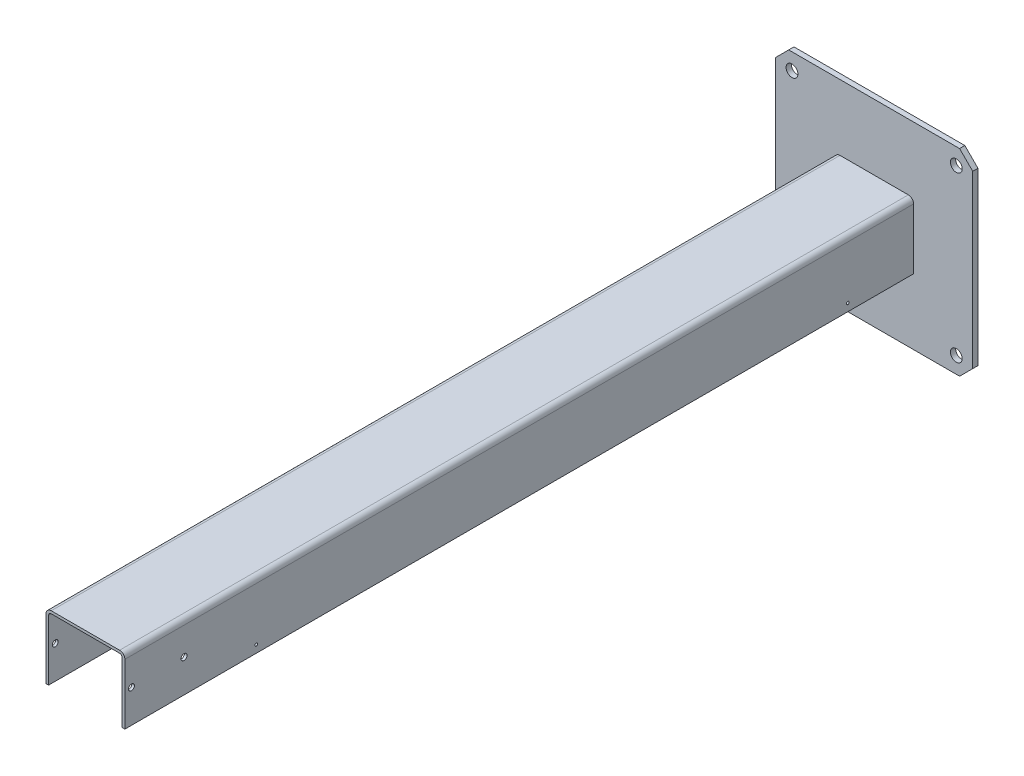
ISO-10303-21;
HEADER;
FILE_DESCRIPTION(('STEP AP214'),'2;1');
FILE_NAME('part.step','',(''),(''),'','','');
FILE_SCHEMA(('AUTOMOTIVE_DESIGN { 1 0 10303 214 1 1 1 1 }'));
ENDSEC;
DATA;
#1=APPLICATION_CONTEXT('core data for automotive mechanical design processes');
#2=APPLICATION_PROTOCOL_DEFINITION('international standard','automotive_design',2000,#1);
#3=PRODUCT_CONTEXT('',#1,'mechanical');
#4=PRODUCT('Part','Part','',(#3));
#5=PRODUCT_RELATED_PRODUCT_CATEGORY('part','',(#4));
#6=PRODUCT_DEFINITION_FORMATION('','',#4);
#7=PRODUCT_DEFINITION_CONTEXT('part definition',#1,'design');
#8=PRODUCT_DEFINITION('design','',#6,#7);
#9=PRODUCT_DEFINITION_SHAPE('','',#8);
#10=(LENGTH_UNIT() NAMED_UNIT(*) SI_UNIT(.MILLI.,.METRE.));
#11=(NAMED_UNIT(*) PLANE_ANGLE_UNIT() SI_UNIT($,.RADIAN.));
#12=(NAMED_UNIT(*) SI_UNIT($,.STERADIAN.) SOLID_ANGLE_UNIT());
#13=UNCERTAINTY_MEASURE_WITH_UNIT(LENGTH_MEASURE(1.E-05),#10,'distance_accuracy_value','');
#14=(GEOMETRIC_REPRESENTATION_CONTEXT(3) GLOBAL_UNCERTAINTY_ASSIGNED_CONTEXT((#13)) GLOBAL_UNIT_ASSIGNED_CONTEXT((#10,
#11,#12)) REPRESENTATION_CONTEXT('',''));
#15=CARTESIAN_POINT('',(0.,0.,0.));
#16=DIRECTION('',(0.,0.,1.));
#17=DIRECTION('',(1.,0.,0.));
#18=AXIS2_PLACEMENT_3D('',#15,#16,#17);
#19=CARTESIAN_POINT('',(-150.,150.,8.));
#20=DIRECTION('',(0.,0.,-1.));
#21=DIRECTION('',(-1.,0.,0.));
#22=AXIS2_PLACEMENT_3D('',#19,#20,#21);
#23=PLANE('',#22);
#24=CARTESIAN_POINT('',(-125.,125.,8.));
#25=DIRECTION('',(0.,0.,1.));
#26=DIRECTION('',(1.,0.,0.));
#27=AXIS2_PLACEMENT_3D('',#24,#25,#26);
#28=CIRCLE('',#27,9.);
#29=CARTESIAN_POINT('',(-116.,125.,8.));
#30=VERTEX_POINT('',#29);
#31=EDGE_CURVE('E379',#30,#30,#28,.T.);
#32=ORIENTED_EDGE('',*,*,#31,.F.);
#33=EDGE_LOOP('',(#32));
#34=FACE_BOUND('',#33,.T.);
#35=CARTESIAN_POINT('',(-125.,-125.,8.));
#36=DIRECTION('',(0.,0.,1.));
#37=DIRECTION('',(1.,0.,0.));
#38=AXIS2_PLACEMENT_3D('',#35,#36,#37);
#39=CIRCLE('',#38,8.99999999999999);
#40=CARTESIAN_POINT('',(-116.,-125.,8.));
#41=VERTEX_POINT('',#40);
#42=EDGE_CURVE('E383',#41,#41,#39,.T.);
#43=ORIENTED_EDGE('',*,*,#42,.F.);
#44=EDGE_LOOP('',(#43));
#45=FACE_BOUND('',#44,.T.);
#46=CARTESIAN_POINT('',(125.,-125.,8.));
#47=DIRECTION('',(0.,0.,1.));
#48=DIRECTION('',(1.,0.,0.));
#49=AXIS2_PLACEMENT_3D('',#46,#47,#48);
#50=CIRCLE('',#49,8.99999999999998);
#51=CARTESIAN_POINT('',(134.,-125.,8.));
#52=VERTEX_POINT('',#51);
#53=EDGE_CURVE('E389',#52,#52,#50,.T.);
#54=ORIENTED_EDGE('',*,*,#53,.F.);
#55=EDGE_LOOP('',(#54));
#56=FACE_BOUND('',#55,.T.);
#57=CARTESIAN_POINT('',(125.,125.,8.));
#58=DIRECTION('',(0.,0.,1.));
#59=DIRECTION('',(1.,0.,0.));
#60=AXIS2_PLACEMENT_3D('',#57,#58,#59);
#61=CIRCLE('',#60,8.99999999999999);
#62=CARTESIAN_POINT('',(134.,125.,8.));
#63=VERTEX_POINT('',#62);
#64=EDGE_CURVE('E395',#63,#63,#61,.T.);
#65=ORIENTED_EDGE('',*,*,#64,.F.);
#66=EDGE_LOOP('',(#65));
#67=FACE_BOUND('',#66,.T.);
#68=DIRECTION('',(0.,-1.,0.));
#69=VECTOR('',#68,1.);
#70=CARTESIAN_POINT('',(-150.,-150.,8.));
#71=LINE('',#70,#69);
#72=CARTESIAN_POINT('',(-150.,130.,8.));
#73=VERTEX_POINT('',#72);
#74=CARTESIAN_POINT('',(-150.,-130.,8.));
#75=VERTEX_POINT('',#74);
#76=EDGE_CURVE('E284',#73,#75,#71,.T.);
#77=ORIENTED_EDGE('',*,*,#76,.T.);
#78=DIRECTION('',(-0.707106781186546,0.70710678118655,0.));
#79=VECTOR('',#78,1.);
#80=CARTESIAN_POINT('',(-130.,-150.,8.));
#81=LINE('',#80,#79);
#82=CARTESIAN_POINT('',(-130.,-150.,8.));
#83=VERTEX_POINT('',#82);
#84=EDGE_CURVE('E327',#75,#83,#81,.F.);
#85=ORIENTED_EDGE('',*,*,#84,.T.);
#86=DIRECTION('',(1.,0.,0.));
#87=VECTOR('',#86,1.);
#88=CARTESIAN_POINT('',(-150.,-150.,8.));
#89=LINE('',#88,#87);
#90=CARTESIAN_POINT('',(130.,-150.,8.));
#91=VERTEX_POINT('',#90);
#92=EDGE_CURVE('E287',#83,#91,#89,.T.);
#93=ORIENTED_EDGE('',*,*,#92,.T.);
#94=DIRECTION('',(-0.70710678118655,-0.707106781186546,0.));
#95=VECTOR('',#94,1.);
#96=CARTESIAN_POINT('',(150.,-130.,8.));
#97=LINE('',#96,#95);
#98=CARTESIAN_POINT('',(150.,-130.,8.));
#99=VERTEX_POINT('',#98);
#100=EDGE_CURVE('E325',#91,#99,#97,.F.);
#101=ORIENTED_EDGE('',*,*,#100,.T.);
#102=DIRECTION('',(0.,1.,0.));
#103=VECTOR('',#102,1.);
#104=CARTESIAN_POINT('',(150.,-150.,8.));
#105=LINE('',#104,#103);
#106=CARTESIAN_POINT('',(150.,130.,8.));
#107=VERTEX_POINT('',#106);
#108=EDGE_CURVE('E291',#99,#107,#105,.T.);
#109=ORIENTED_EDGE('',*,*,#108,.T.);
#110=DIRECTION('',(0.707106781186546,-0.70710678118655,0.));
#111=VECTOR('',#110,1.);
#112=CARTESIAN_POINT('',(130.,150.,8.));
#113=LINE('',#112,#111);
#114=CARTESIAN_POINT('',(130.,150.,8.));
#115=VERTEX_POINT('',#114);
#116=EDGE_CURVE('E57',#107,#115,#113,.F.);
#117=ORIENTED_EDGE('',*,*,#116,.T.);
#118=DIRECTION('',(-1.,0.,0.));
#119=VECTOR('',#118,1.);
#120=CARTESIAN_POINT('',(-150.,150.,8.));
#121=LINE('',#120,#119);
#122=CARTESIAN_POINT('',(-130.,150.,8.));
#123=VERTEX_POINT('',#122);
#124=EDGE_CURVE('E293',#115,#123,#121,.T.);
#125=ORIENTED_EDGE('',*,*,#124,.T.);
#126=DIRECTION('',(0.70710678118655,0.707106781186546,0.));
#127=VECTOR('',#126,1.);
#128=CARTESIAN_POINT('',(-150.,130.,8.));
#129=LINE('',#128,#127);
#130=EDGE_CURVE('E322',#123,#73,#129,.F.);
#131=ORIENTED_EDGE('',*,*,#130,.T.);
#132=EDGE_LOOP('',(#77,#85,#93,#101,#109,#117,#125,#131));
#133=FACE_BOUND('',#132,.T.);
#134=DIRECTION('',(0.,-1.,0.));
#135=VECTOR('',#134,1.);
#136=CARTESIAN_POINT('',(56.,42.,8.));
#137=LINE('',#136,#135);
#138=CARTESIAN_POINT('',(56.,42.,8.));
#139=VERTEX_POINT('',#138);
#140=CARTESIAN_POINT('',(56.,-50.,8.));
#141=VERTEX_POINT('',#140);
#142=EDGE_CURVE('E192',#139,#141,#137,.T.);
#143=ORIENTED_EDGE('',*,*,#142,.F.);
#144=CARTESIAN_POINT('',(52.,42.,8.));
#145=DIRECTION('',(0.,0.,1.));
#146=DIRECTION('',(1.,0.,0.));
#147=AXIS2_PLACEMENT_3D('',#144,#145,#146);
#148=CIRCLE('',#147,4.);
#149=CARTESIAN_POINT('',(52.,46.,8.00000000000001));
#150=VERTEX_POINT('',#149);
#151=EDGE_CURVE('E186',#150,#139,#148,.F.);
#152=ORIENTED_EDGE('',*,*,#151,.F.);
#153=DIRECTION('',(1.,0.,0.));
#154=VECTOR('',#153,1.);
#155=CARTESIAN_POINT('',(-52.,46.,8.));
#156=LINE('',#155,#154);
#157=CARTESIAN_POINT('',(-52.,46.,8.));
#158=VERTEX_POINT('',#157);
#159=EDGE_CURVE('E250',#158,#150,#156,.T.);
#160=ORIENTED_EDGE('',*,*,#159,.F.);
#161=CARTESIAN_POINT('',(-52.,42.,8.));
#162=DIRECTION('',(0.,0.,1.));
#163=DIRECTION('',(1.,0.,0.));
#164=AXIS2_PLACEMENT_3D('',#161,#162,#163);
#165=CIRCLE('',#164,4.);
#166=CARTESIAN_POINT('',(-56.,42.,8.00000000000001));
#167=VERTEX_POINT('',#166);
#168=EDGE_CURVE('E247',#167,#158,#165,.F.);
#169=ORIENTED_EDGE('',*,*,#168,.F.);
#170=DIRECTION('',(0.,1.,0.));
#171=VECTOR('',#170,1.);
#172=CARTESIAN_POINT('',(-56.,-50.,8.));
#173=LINE('',#172,#171);
#174=CARTESIAN_POINT('',(-56.,-50.,8.));
#175=VERTEX_POINT('',#174);
#176=EDGE_CURVE('E244',#175,#167,#173,.T.);
#177=ORIENTED_EDGE('',*,*,#176,.F.);
#178=DIRECTION('',(-1.,0.,0.));
#179=VECTOR('',#178,1.);
#180=CARTESIAN_POINT('',(-56.,-50.,8.));
#181=LINE('',#180,#179);
#182=CARTESIAN_POINT('',(-60.,-50.,8.));
#183=VERTEX_POINT('',#182);
#184=EDGE_CURVE('E242',#175,#183,#181,.T.);
#185=ORIENTED_EDGE('',*,*,#184,.T.);
#186=DIRECTION('',(0.,1.,0.));
#187=VECTOR('',#186,1.);
#188=CARTESIAN_POINT('',(-60.,-50.,8.));
#189=LINE('',#188,#187);
#190=CARTESIAN_POINT('',(-60.,42.,8.));
#191=VERTEX_POINT('',#190);
#192=EDGE_CURVE('E240',#183,#191,#189,.T.);
#193=ORIENTED_EDGE('',*,*,#192,.T.);
#194=CARTESIAN_POINT('',(-52.,42.,8.));
#195=DIRECTION('',(0.,0.,-1.));
#196=DIRECTION('',(-1.,0.,0.));
#197=AXIS2_PLACEMENT_3D('',#194,#195,#196);
#198=CIRCLE('',#197,8.);
#199=CARTESIAN_POINT('',(-52.,50.,8.00000000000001));
#200=VERTEX_POINT('',#199);
#201=EDGE_CURVE('E238',#191,#200,#198,.T.);
#202=ORIENTED_EDGE('',*,*,#201,.T.);
#203=DIRECTION('',(1.,0.,0.));
#204=VECTOR('',#203,1.);
#205=CARTESIAN_POINT('',(-52.,50.,8.));
#206=LINE('',#205,#204);
#207=CARTESIAN_POINT('',(52.,50.,8.));
#208=VERTEX_POINT('',#207);
#209=EDGE_CURVE('E236',#200,#208,#206,.T.);
#210=ORIENTED_EDGE('',*,*,#209,.T.);
#211=CARTESIAN_POINT('',(52.,42.,8.));
#212=DIRECTION('',(0.,0.,-1.));
#213=DIRECTION('',(-1.,0.,0.));
#214=AXIS2_PLACEMENT_3D('',#211,#212,#213);
#215=CIRCLE('',#214,8.);
#216=CARTESIAN_POINT('',(60.,42.,8.00000000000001));
#217=VERTEX_POINT('',#216);
#218=EDGE_CURVE('E234',#208,#217,#215,.T.);
#219=ORIENTED_EDGE('',*,*,#218,.T.);
#220=DIRECTION('',(0.,-1.,0.));
#221=VECTOR('',#220,1.);
#222=CARTESIAN_POINT('',(60.,42.,8.));
#223=LINE('',#222,#221);
#224=CARTESIAN_POINT('',(60.,-50.,8.));
#225=VERTEX_POINT('',#224);
#226=EDGE_CURVE('E232',#217,#225,#223,.T.);
#227=ORIENTED_EDGE('',*,*,#226,.T.);
#228=DIRECTION('',(-1.,0.,0.));
#229=VECTOR('',#228,1.);
#230=CARTESIAN_POINT('',(60.,-50.,8.));
#231=LINE('',#230,#229);
#232=EDGE_CURVE('E229',#225,#141,#231,.T.);
#233=ORIENTED_EDGE('',*,*,#232,.T.);
#234=EDGE_LOOP('',(#143,#152,#160,#169,#177,#185,#193,#202,#210,#219,#227,#233));
#235=FACE_BOUND('',#234,.T.);
#236=ADVANCED_FACE('F34',(#34,#45,#56,#67,#133,#235),#23,.F.);
#237=CARTESIAN_POINT('',(-150.,-150.,8.));
#238=DIRECTION('',(1.,0.,0.));
#239=DIRECTION('',(0.,0.,-1.));
#240=AXIS2_PLACEMENT_3D('',#237,#238,#239);
#241=PLANE('',#240);
#242=DIRECTION('',(0.,-1.,0.));
#243=VECTOR('',#242,1.);
#244=CARTESIAN_POINT('',(-150.,-150.,0.));
#245=LINE('',#244,#243);
#246=CARTESIAN_POINT('',(-150.,130.,0.));
#247=VERTEX_POINT('',#246);
#248=CARTESIAN_POINT('',(-150.,-130.,0.));
#249=VERTEX_POINT('',#248);
#250=EDGE_CURVE('E195',#247,#249,#245,.T.);
#251=ORIENTED_EDGE('',*,*,#250,.T.);
#252=DIRECTION('',(0.,0.,1.));
#253=VECTOR('',#252,1.);
#254=CARTESIAN_POINT('',(-150.,-130.,8.));
#255=LINE('',#254,#253);
#256=EDGE_CURVE('E320',#249,#75,#255,.T.);
#257=ORIENTED_EDGE('',*,*,#256,.T.);
#258=ORIENTED_EDGE('',*,*,#76,.F.);
#259=DIRECTION('',(0.,0.,-1.));
#260=VECTOR('',#259,1.);
#261=CARTESIAN_POINT('',(-150.,130.,8.));
#262=LINE('',#261,#260);
#263=EDGE_CURVE('E317',#73,#247,#262,.T.);
#264=ORIENTED_EDGE('',*,*,#263,.T.);
#265=EDGE_LOOP('',(#251,#257,#258,#264));
#266=FACE_BOUND('',#265,.T.);
#267=ADVANCED_FACE('F405',(#266),#241,.F.);
#268=CARTESIAN_POINT('',(-150.,-150.,8.));
#269=DIRECTION('',(0.,1.,0.));
#270=DIRECTION('',(0.,0.,1.));
#271=AXIS2_PLACEMENT_3D('',#268,#269,#270);
#272=PLANE('',#271);
#273=ORIENTED_EDGE('',*,*,#92,.F.);
#274=DIRECTION('',(0.,0.,-1.));
#275=VECTOR('',#274,1.);
#276=CARTESIAN_POINT('',(-130.,-150.,8.));
#277=LINE('',#276,#275);
#278=CARTESIAN_POINT('',(-130.,-150.,0.));
#279=VERTEX_POINT('',#278);
#280=EDGE_CURVE('E306',#83,#279,#277,.T.);
#281=ORIENTED_EDGE('',*,*,#280,.T.);
#282=DIRECTION('',(1.,0.,0.));
#283=VECTOR('',#282,1.);
#284=CARTESIAN_POINT('',(-150.,-150.,0.));
#285=LINE('',#284,#283);
#286=CARTESIAN_POINT('',(130.,-150.,0.));
#287=VERTEX_POINT('',#286);
#288=EDGE_CURVE('E298',#279,#287,#285,.T.);
#289=ORIENTED_EDGE('',*,*,#288,.T.);
#290=DIRECTION('',(0.,0.,1.));
#291=VECTOR('',#290,1.);
#292=CARTESIAN_POINT('',(130.,-150.,8.));
#293=LINE('',#292,#291);
#294=EDGE_CURVE('E295',#287,#91,#293,.T.);
#295=ORIENTED_EDGE('',*,*,#294,.T.);
#296=EDGE_LOOP('',(#273,#281,#289,#295));
#297=FACE_BOUND('',#296,.T.);
#298=ADVANCED_FACE('F474',(#297),#272,.F.);
#299=CARTESIAN_POINT('',(150.,-150.,8.));
#300=DIRECTION('',(-1.,0.,0.));
#301=DIRECTION('',(0.,0.,1.));
#302=AXIS2_PLACEMENT_3D('',#299,#300,#301);
#303=PLANE('',#302);
#304=ORIENTED_EDGE('',*,*,#108,.F.);
#305=DIRECTION('',(0.,0.,-1.));
#306=VECTOR('',#305,1.);
#307=CARTESIAN_POINT('',(150.,-130.,8.));
#308=LINE('',#307,#306);
#309=CARTESIAN_POINT('',(150.,-130.,0.));
#310=VERTEX_POINT('',#309);
#311=EDGE_CURVE('E331',#99,#310,#308,.T.);
#312=ORIENTED_EDGE('',*,*,#311,.T.);
#313=DIRECTION('',(0.,1.,0.));
#314=VECTOR('',#313,1.);
#315=CARTESIAN_POINT('',(150.,-150.,0.));
#316=LINE('',#315,#314);
#317=CARTESIAN_POINT('',(150.,130.,0.));
#318=VERTEX_POINT('',#317);
#319=EDGE_CURVE('E301',#310,#318,#316,.T.);
#320=ORIENTED_EDGE('',*,*,#319,.T.);
#321=DIRECTION('',(0.,0.,1.));
#322=VECTOR('',#321,1.);
#323=CARTESIAN_POINT('',(150.,130.,8.));
#324=LINE('',#323,#322);
#325=EDGE_CURVE('E329',#318,#107,#324,.T.);
#326=ORIENTED_EDGE('',*,*,#325,.T.);
#327=EDGE_LOOP('',(#304,#312,#320,#326));
#328=FACE_BOUND('',#327,.T.);
#329=ADVANCED_FACE('F471',(#328),#303,.F.);
#330=CARTESIAN_POINT('',(-150.,150.,8.));
#331=DIRECTION('',(0.,-1.,0.));
#332=DIRECTION('',(0.,0.,-1.));
#333=AXIS2_PLACEMENT_3D('',#330,#331,#332);
#334=PLANE('',#333);
#335=ORIENTED_EDGE('',*,*,#124,.F.);
#336=DIRECTION('',(0.,0.,-1.));
#337=VECTOR('',#336,1.);
#338=CARTESIAN_POINT('',(130.,150.,8.));
#339=LINE('',#338,#337);
#340=CARTESIAN_POINT('',(130.,150.,0.));
#341=VERTEX_POINT('',#340);
#342=EDGE_CURVE('E11',#115,#341,#339,.T.);
#343=ORIENTED_EDGE('',*,*,#342,.T.);
#344=DIRECTION('',(-1.,0.,0.));
#345=VECTOR('',#344,1.);
#346=CARTESIAN_POINT('',(-150.,150.,0.));
#347=LINE('',#346,#345);
#348=CARTESIAN_POINT('',(-130.,150.,0.));
#349=VERTEX_POINT('',#348);
#350=EDGE_CURVE('E288',#341,#349,#347,.T.);
#351=ORIENTED_EDGE('',*,*,#350,.T.);
#352=DIRECTION('',(0.,0.,1.));
#353=VECTOR('',#352,1.);
#354=CARTESIAN_POINT('',(-130.,150.,8.));
#355=LINE('',#354,#353);
#356=EDGE_CURVE('E43',#349,#123,#355,.T.);
#357=ORIENTED_EDGE('',*,*,#356,.T.);
#358=EDGE_LOOP('',(#335,#343,#351,#357));
#359=FACE_BOUND('',#358,.T.);
#360=ADVANCED_FACE('F467',(#359),#334,.F.);
#361=CARTESIAN_POINT('',(-150.,150.,0.));
#362=DIRECTION('',(0.,0.,-1.));
#363=DIRECTION('',(-1.,0.,0.));
#364=AXIS2_PLACEMENT_3D('',#361,#362,#363);
#365=PLANE('',#364);
#366=CARTESIAN_POINT('',(-125.,125.,0.));
#367=DIRECTION('',(0.,0.,1.));
#368=DIRECTION('',(1.,0.,0.));
#369=AXIS2_PLACEMENT_3D('',#366,#367,#368);
#370=CIRCLE('',#369,9.);
#371=CARTESIAN_POINT('',(-116.,125.,0.));
#372=VERTEX_POINT('',#371);
#373=EDGE_CURVE('E380',#372,#372,#370,.T.);
#374=ORIENTED_EDGE('',*,*,#373,.T.);
#375=EDGE_LOOP('',(#374));
#376=FACE_BOUND('',#375,.T.);
#377=CARTESIAN_POINT('',(-125.,-125.,0.));
#378=DIRECTION('',(0.,0.,1.));
#379=DIRECTION('',(1.,0.,0.));
#380=AXIS2_PLACEMENT_3D('',#377,#378,#379);
#381=CIRCLE('',#380,8.99999999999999);
#382=CARTESIAN_POINT('',(-116.,-125.,0.));
#383=VERTEX_POINT('',#382);
#384=EDGE_CURVE('E386',#383,#383,#381,.T.);
#385=ORIENTED_EDGE('',*,*,#384,.T.);
#386=EDGE_LOOP('',(#385));
#387=FACE_BOUND('',#386,.T.);
#388=CARTESIAN_POINT('',(125.,-125.,0.));
#389=DIRECTION('',(0.,0.,1.));
#390=DIRECTION('',(1.,0.,0.));
#391=AXIS2_PLACEMENT_3D('',#388,#389,#390);
#392=CIRCLE('',#391,8.99999999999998);
#393=CARTESIAN_POINT('',(134.,-125.,0.));
#394=VERTEX_POINT('',#393);
#395=EDGE_CURVE('E392',#394,#394,#392,.T.);
#396=ORIENTED_EDGE('',*,*,#395,.T.);
#397=EDGE_LOOP('',(#396));
#398=FACE_BOUND('',#397,.T.);
#399=CARTESIAN_POINT('',(125.,125.,0.));
#400=DIRECTION('',(0.,0.,1.));
#401=DIRECTION('',(1.,0.,0.));
#402=AXIS2_PLACEMENT_3D('',#399,#400,#401);
#403=CIRCLE('',#402,8.99999999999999);
#404=CARTESIAN_POINT('',(134.,125.,0.));
#405=VERTEX_POINT('',#404);
#406=EDGE_CURVE('E230',#405,#405,#403,.T.);
#407=ORIENTED_EDGE('',*,*,#406,.T.);
#408=EDGE_LOOP('',(#407));
#409=FACE_BOUND('',#408,.T.);
#410=ORIENTED_EDGE('',*,*,#288,.F.);
#411=DIRECTION('',(0.707106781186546,-0.70710678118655,0.));
#412=VECTOR('',#411,1.);
#413=CARTESIAN_POINT('',(-290.,10.0000000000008,0.));
#414=LINE('',#413,#412);
#415=EDGE_CURVE('E315',#279,#249,#414,.F.);
#416=ORIENTED_EDGE('',*,*,#415,.T.);
#417=ORIENTED_EDGE('',*,*,#250,.F.);
#418=DIRECTION('',(-0.70710678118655,-0.707106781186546,0.));
#419=VECTOR('',#418,1.);
#420=CARTESIAN_POINT('',(-140.,140.,0.));
#421=LINE('',#420,#419);
#422=EDGE_CURVE('E309',#247,#349,#421,.F.);
#423=ORIENTED_EDGE('',*,*,#422,.T.);
#424=ORIENTED_EDGE('',*,*,#350,.F.);
#425=DIRECTION('',(-0.707106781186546,0.70710678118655,0.));
#426=VECTOR('',#425,1.);
#427=CARTESIAN_POINT('',(-9.99999999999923,290.,0.));
#428=LINE('',#427,#426);
#429=EDGE_CURVE('E311',#341,#318,#428,.F.);
#430=ORIENTED_EDGE('',*,*,#429,.T.);
#431=ORIENTED_EDGE('',*,*,#319,.F.);
#432=DIRECTION('',(0.70710678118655,0.707106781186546,0.));
#433=VECTOR('',#432,1.);
#434=CARTESIAN_POINT('',(139.999999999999,-140.000000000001,0.));
#435=LINE('',#434,#433);
#436=EDGE_CURVE('E313',#310,#287,#435,.F.);
#437=ORIENTED_EDGE('',*,*,#436,.T.);
#438=EDGE_LOOP('',(#410,#416,#417,#423,#424,#430,#431,#437));
#439=FACE_BOUND('',#438,.T.);
#440=ADVANCED_FACE('F462',(#376,#387,#398,#409,#439),#365,.T.);
#441=CARTESIAN_POINT('',(56.,42.,1208.));
#442=DIRECTION('',(1.,0.,0.));
#443=DIRECTION('',(0.,1.,0.));
#444=AXIS2_PLACEMENT_3D('',#441,#442,#443);
#445=PLANE('',#444);
#446=CARTESIAN_POINT('',(56.,0.,1118.));
#447=DIRECTION('',(1.,0.,0.));
#448=DIRECTION('',(0.,1.,0.));
#449=AXIS2_PLACEMENT_3D('',#446,#447,#448);
#450=CIRCLE('',#449,4.50000000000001);
#451=CARTESIAN_POINT('',(56.,4.50000000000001,1118.));
#452=VERTEX_POINT('',#451);
#453=EDGE_CURVE('E354',#452,#452,#450,.T.);
#454=ORIENTED_EDGE('',*,*,#453,.T.);
#455=EDGE_LOOP('',(#454));
#456=FACE_BOUND('',#455,.T.);
#457=CARTESIAN_POINT('',(56.,0.,1198.));
#458=DIRECTION('',(1.,0.,0.));
#459=DIRECTION('',(0.,1.,0.));
#460=AXIS2_PLACEMENT_3D('',#457,#458,#459);
#461=CIRCLE('',#460,4.50000000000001);
#462=CARTESIAN_POINT('',(56.,4.50000000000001,1198.));
#463=VERTEX_POINT('',#462);
#464=EDGE_CURVE('E351',#463,#463,#461,.T.);
#465=ORIENTED_EDGE('',*,*,#464,.T.);
#466=EDGE_LOOP('',(#465));
#467=FACE_BOUND('',#466,.T.);
#468=CARTESIAN_POINT('',(56.,-38.5,1008.));
#469=DIRECTION('',(1.,0.,0.));
#470=DIRECTION('',(0.,1.,0.));
#471=AXIS2_PLACEMENT_3D('',#468,#469,#470);
#472=CIRCLE('',#471,2.09999999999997);
#473=CARTESIAN_POINT('',(56.,-36.4,1008.));
#474=VERTEX_POINT('',#473);
#475=EDGE_CURVE('E369',#474,#474,#472,.T.);
#476=ORIENTED_EDGE('',*,*,#475,.T.);
#477=EDGE_LOOP('',(#476));
#478=FACE_BOUND('',#477,.T.);
#479=CARTESIAN_POINT('',(56.,-38.5,108.));
#480=DIRECTION('',(1.,0.,0.));
#481=DIRECTION('',(0.,1.,0.));
#482=AXIS2_PLACEMENT_3D('',#479,#480,#481);
#483=CIRCLE('',#482,2.09999999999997);
#484=CARTESIAN_POINT('',(56.,-36.4,108.));
#485=VERTEX_POINT('',#484);
#486=EDGE_CURVE('E376',#485,#485,#483,.T.);
#487=ORIENTED_EDGE('',*,*,#486,.T.);
#488=EDGE_LOOP('',(#487));
#489=FACE_BOUND('',#488,.T.);
#490=ORIENTED_EDGE('',*,*,#142,.T.);
#491=DIRECTION('',(0.,0.,-1.));
#492=VECTOR('',#491,1.);
#493=CARTESIAN_POINT('',(56.,-50.,1208.));
#494=LINE('',#493,#492);
#495=CARTESIAN_POINT('',(56.,-50.,1208.));
#496=VERTEX_POINT('',#495);
#497=EDGE_CURVE('E190',#496,#141,#494,.T.);
#498=ORIENTED_EDGE('',*,*,#497,.F.);
#499=DIRECTION('',(0.,-1.,0.));
#500=VECTOR('',#499,1.);
#501=CARTESIAN_POINT('',(56.,42.,1208.));
#502=LINE('',#501,#500);
#503=CARTESIAN_POINT('',(56.,42.,1208.));
#504=VERTEX_POINT('',#503);
#505=EDGE_CURVE('E174',#504,#496,#502,.T.);
#506=ORIENTED_EDGE('',*,*,#505,.F.);
#507=DIRECTION('',(0.,0.,-1.));
#508=VECTOR('',#507,1.);
#509=CARTESIAN_POINT('',(56.,42.,1208.));
#510=LINE('',#509,#508);
#511=EDGE_CURVE('E227',#504,#139,#510,.T.);
#512=ORIENTED_EDGE('',*,*,#511,.T.);
#513=EDGE_LOOP('',(#490,#498,#506,#512));
#514=FACE_BOUND('',#513,.T.);
#515=ADVANCED_FACE('F191',(#456,#467,#478,#489,#514),#445,.F.);
#516=CARTESIAN_POINT('',(60.,-50.,1208.));
#517=DIRECTION('',(0.,-1.,0.));
#518=DIRECTION('',(1.,0.,0.));
#519=AXIS2_PLACEMENT_3D('',#516,#517,#518);
#520=PLANE('',#519);
#521=ORIENTED_EDGE('',*,*,#232,.F.);
#522=DIRECTION('',(0.,0.,-1.));
#523=VECTOR('',#522,1.);
#524=CARTESIAN_POINT('',(60.,-50.,1208.));
#525=LINE('',#524,#523);
#526=CARTESIAN_POINT('',(60.,-50.,1208.));
#527=VERTEX_POINT('',#526);
#528=EDGE_CURVE('E196',#527,#225,#525,.T.);
#529=ORIENTED_EDGE('',*,*,#528,.F.);
#530=DIRECTION('',(-1.,0.,0.));
#531=VECTOR('',#530,1.);
#532=CARTESIAN_POINT('',(60.,-50.,1208.));
#533=LINE('',#532,#531);
#534=EDGE_CURVE('E179',#527,#496,#533,.T.);
#535=ORIENTED_EDGE('',*,*,#534,.T.);
#536=ORIENTED_EDGE('',*,*,#497,.T.);
#537=EDGE_LOOP('',(#521,#529,#535,#536));
#538=FACE_BOUND('',#537,.T.);
#539=ADVANCED_FACE('F198',(#538),#520,.T.);
#540=CARTESIAN_POINT('',(60.,42.,1208.));
#541=DIRECTION('',(1.,0.,0.));
#542=DIRECTION('',(0.,1.,0.));
#543=AXIS2_PLACEMENT_3D('',#540,#541,#542);
#544=PLANE('',#543);
#545=CARTESIAN_POINT('',(60.,0.,1118.));
#546=DIRECTION('',(1.,0.,0.));
#547=DIRECTION('',(0.,1.,0.));
#548=AXIS2_PLACEMENT_3D('',#545,#546,#547);
#549=CIRCLE('',#548,4.50000000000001);
#550=CARTESIAN_POINT('',(60.,4.50000000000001,1118.));
#551=VERTEX_POINT('',#550);
#552=EDGE_CURVE('E359',#551,#551,#549,.T.);
#553=ORIENTED_EDGE('',*,*,#552,.F.);
#554=EDGE_LOOP('',(#553));
#555=FACE_BOUND('',#554,.T.);
#556=CARTESIAN_POINT('',(60.,0.,1198.));
#557=DIRECTION('',(1.,0.,0.));
#558=DIRECTION('',(0.,1.,0.));
#559=AXIS2_PLACEMENT_3D('',#556,#557,#558);
#560=CIRCLE('',#559,4.50000000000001);
#561=CARTESIAN_POINT('',(60.,4.50000000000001,1198.));
#562=VERTEX_POINT('',#561);
#563=EDGE_CURVE('E346',#562,#562,#560,.T.);
#564=ORIENTED_EDGE('',*,*,#563,.F.);
#565=EDGE_LOOP('',(#564));
#566=FACE_BOUND('',#565,.T.);
#567=CARTESIAN_POINT('',(60.,-38.5,1008.));
#568=DIRECTION('',(1.,0.,0.));
#569=DIRECTION('',(0.,0.,-1.));
#570=AXIS2_PLACEMENT_3D('',#567,#568,#569);
#571=CIRCLE('',#570,2.09999999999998);
#572=CARTESIAN_POINT('',(60.,-38.5,1005.9));
#573=VERTEX_POINT('',#572);
#574=EDGE_CURVE('E343',#573,#573,#571,.T.);
#575=ORIENTED_EDGE('',*,*,#574,.F.);
#576=EDGE_LOOP('',(#575));
#577=FACE_BOUND('',#576,.T.);
#578=CARTESIAN_POINT('',(60.,-38.5,108.));
#579=DIRECTION('',(1.,0.,0.));
#580=DIRECTION('',(0.,0.,-1.));
#581=AXIS2_PLACEMENT_3D('',#578,#579,#580);
#582=CIRCLE('',#581,2.09999999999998);
#583=CARTESIAN_POINT('',(60.,-38.5,105.9));
#584=VERTEX_POINT('',#583);
#585=EDGE_CURVE('E339',#584,#584,#582,.T.);
#586=ORIENTED_EDGE('',*,*,#585,.F.);
#587=EDGE_LOOP('',(#586));
#588=FACE_BOUND('',#587,.T.);
#589=ORIENTED_EDGE('',*,*,#226,.F.);
#590=DIRECTION('',(0.,0.,-1.));
#591=VECTOR('',#590,1.);
#592=CARTESIAN_POINT('',(60.,42.,1208.));
#593=LINE('',#592,#591);
#594=CARTESIAN_POINT('',(60.,42.,1208.));
#595=VERTEX_POINT('',#594);
#596=EDGE_CURVE('E280',#595,#217,#593,.T.);
#597=ORIENTED_EDGE('',*,*,#596,.F.);
#598=DIRECTION('',(0.,-1.,0.));
#599=VECTOR('',#598,1.);
#600=CARTESIAN_POINT('',(60.,42.,1208.));
#601=LINE('',#600,#599);
#602=EDGE_CURVE('E200',#595,#527,#601,.T.);
#603=ORIENTED_EDGE('',*,*,#602,.T.);
#604=ORIENTED_EDGE('',*,*,#528,.T.);
#605=EDGE_LOOP('',(#589,#597,#603,#604));
#606=FACE_BOUND('',#605,.T.);
#607=ADVANCED_FACE('F447',(#555,#566,#577,#588,#606),#544,.T.);
#608=CARTESIAN_POINT('',(52.,42.,1208.));
#609=DIRECTION('',(0.,0.,-1.));
#610=DIRECTION('',(-1.,0.,0.));
#611=AXIS2_PLACEMENT_3D('',#608,#609,#610);
#612=CYLINDRICAL_SURFACE('',#611,8.);
#613=ORIENTED_EDGE('',*,*,#218,.F.);
#614=DIRECTION('',(0.,0.,-1.));
#615=VECTOR('',#614,1.);
#616=CARTESIAN_POINT('',(52.,50.,1208.));
#617=LINE('',#616,#615);
#618=CARTESIAN_POINT('',(52.,50.,1208.));
#619=VERTEX_POINT('',#618);
#620=EDGE_CURVE('E277',#619,#208,#617,.T.);
#621=ORIENTED_EDGE('',*,*,#620,.F.);
#622=CARTESIAN_POINT('',(52.,42.,1208.));
#623=DIRECTION('',(0.,0.,-1.));
#624=DIRECTION('',(-1.,0.,0.));
#625=AXIS2_PLACEMENT_3D('',#622,#623,#624);
#626=CIRCLE('',#625,8.);
#627=EDGE_CURVE('E202',#619,#595,#626,.T.);
#628=ORIENTED_EDGE('',*,*,#627,.T.);
#629=ORIENTED_EDGE('',*,*,#596,.T.);
#630=EDGE_LOOP('',(#613,#621,#628,#629));
#631=FACE_BOUND('',#630,.T.);
#632=ADVANCED_FACE('F444',(#631),#612,.T.);
#633=CARTESIAN_POINT('',(-52.,50.,1208.));
#634=DIRECTION('',(0.,1.,0.));
#635=DIRECTION('',(0.,0.,1.));
#636=AXIS2_PLACEMENT_3D('',#633,#634,#635);
#637=PLANE('',#636);
#638=ORIENTED_EDGE('',*,*,#209,.F.);
#639=DIRECTION('',(0.,0.,-1.));
#640=VECTOR('',#639,1.);
#641=CARTESIAN_POINT('',(-52.,50.,1208.));
#642=LINE('',#641,#640);
#643=CARTESIAN_POINT('',(-52.,50.,1208.));
#644=VERTEX_POINT('',#643);
#645=EDGE_CURVE('E274',#644,#200,#642,.T.);
#646=ORIENTED_EDGE('',*,*,#645,.F.);
#647=DIRECTION('',(1.,0.,0.));
#648=VECTOR('',#647,1.);
#649=CARTESIAN_POINT('',(-52.,50.,1208.));
#650=LINE('',#649,#648);
#651=EDGE_CURVE('E208',#644,#619,#650,.T.);
#652=ORIENTED_EDGE('',*,*,#651,.T.);
#653=ORIENTED_EDGE('',*,*,#620,.T.);
#654=EDGE_LOOP('',(#638,#646,#652,#653));
#655=FACE_BOUND('',#654,.T.);
#656=ADVANCED_FACE('F440',(#655),#637,.T.);
#657=CARTESIAN_POINT('',(-52.,42.,1208.));
#658=DIRECTION('',(0.,0.,-1.));
#659=DIRECTION('',(-1.,0.,0.));
#660=AXIS2_PLACEMENT_3D('',#657,#658,#659);
#661=CYLINDRICAL_SURFACE('',#660,8.);
#662=ORIENTED_EDGE('',*,*,#201,.F.);
#663=DIRECTION('',(0.,0.,-1.));
#664=VECTOR('',#663,1.);
#665=CARTESIAN_POINT('',(-60.,42.,1208.));
#666=LINE('',#665,#664);
#667=CARTESIAN_POINT('',(-60.,42.,1208.));
#668=VERTEX_POINT('',#667);
#669=EDGE_CURVE('E271',#668,#191,#666,.T.);
#670=ORIENTED_EDGE('',*,*,#669,.F.);
#671=CARTESIAN_POINT('',(-52.,42.,1208.));
#672=DIRECTION('',(0.,0.,-1.));
#673=DIRECTION('',(-1.,0.,0.));
#674=AXIS2_PLACEMENT_3D('',#671,#672,#673);
#675=CIRCLE('',#674,8.);
#676=EDGE_CURVE('E211',#668,#644,#675,.T.);
#677=ORIENTED_EDGE('',*,*,#676,.T.);
#678=ORIENTED_EDGE('',*,*,#645,.T.);
#679=EDGE_LOOP('',(#662,#670,#677,#678));
#680=FACE_BOUND('',#679,.T.);
#681=ADVANCED_FACE('F436',(#680),#661,.T.);
#682=CARTESIAN_POINT('',(-60.,-50.,1208.));
#683=DIRECTION('',(-1.,0.,0.));
#684=DIRECTION('',(0.,0.,1.));
#685=AXIS2_PLACEMENT_3D('',#682,#683,#684);
#686=PLANE('',#685);
#687=CARTESIAN_POINT('',(-60.,0.,1118.));
#688=DIRECTION('',(-1.,0.,0.));
#689=DIRECTION('',(0.,0.,1.));
#690=AXIS2_PLACEMENT_3D('',#687,#688,#689);
#691=CIRCLE('',#690,4.50000000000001);
#692=CARTESIAN_POINT('',(-60.,0.,1122.5));
#693=VERTEX_POINT('',#692);
#694=EDGE_CURVE('E800',#693,#693,#691,.T.);
#695=ORIENTED_EDGE('',*,*,#694,.F.);
#696=EDGE_LOOP('',(#695));
#697=FACE_BOUND('',#696,.T.);
#698=CARTESIAN_POINT('',(-60.,0.,1198.));
#699=DIRECTION('',(-1.,0.,0.));
#700=DIRECTION('',(0.,0.,1.));
#701=AXIS2_PLACEMENT_3D('',#698,#699,#700);
#702=CIRCLE('',#701,4.50000000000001);
#703=CARTESIAN_POINT('',(-60.,0.,1202.5));
#704=VERTEX_POINT('',#703);
#705=EDGE_CURVE('E347',#704,#704,#702,.T.);
#706=ORIENTED_EDGE('',*,*,#705,.F.);
#707=EDGE_LOOP('',(#706));
#708=FACE_BOUND('',#707,.T.);
#709=CARTESIAN_POINT('',(-60.,-38.5,1008.));
#710=DIRECTION('',(-1.,0.,0.));
#711=DIRECTION('',(0.,0.,1.));
#712=AXIS2_PLACEMENT_3D('',#709,#710,#711);
#713=CIRCLE('',#712,2.09999999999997);
#714=CARTESIAN_POINT('',(-60.,-38.5,1010.1));
#715=VERTEX_POINT('',#714);
#716=EDGE_CURVE('E342',#715,#715,#713,.T.);
#717=ORIENTED_EDGE('',*,*,#716,.F.);
#718=EDGE_LOOP('',(#717));
#719=FACE_BOUND('',#718,.T.);
#720=CARTESIAN_POINT('',(-60.,-38.5,108.));
#721=DIRECTION('',(-1.,0.,0.));
#722=DIRECTION('',(0.,0.,1.));
#723=AXIS2_PLACEMENT_3D('',#720,#721,#722);
#724=CIRCLE('',#723,2.09999999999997);
#725=CARTESIAN_POINT('',(-60.,-38.5,110.1));
#726=VERTEX_POINT('',#725);
#727=EDGE_CURVE('E338',#726,#726,#724,.T.);
#728=ORIENTED_EDGE('',*,*,#727,.F.);
#729=EDGE_LOOP('',(#728));
#730=FACE_BOUND('',#729,.T.);
#731=ORIENTED_EDGE('',*,*,#192,.F.);
#732=DIRECTION('',(0.,0.,-1.));
#733=VECTOR('',#732,1.);
#734=CARTESIAN_POINT('',(-60.,-50.,1208.));
#735=LINE('',#734,#733);
#736=CARTESIAN_POINT('',(-60.,-50.,1208.));
#737=VERTEX_POINT('',#736);
#738=EDGE_CURVE('E268',#737,#183,#735,.T.);
#739=ORIENTED_EDGE('',*,*,#738,.F.);
#740=DIRECTION('',(0.,1.,0.));
#741=VECTOR('',#740,1.);
#742=CARTESIAN_POINT('',(-60.,-50.,1208.));
#743=LINE('',#742,#741);
#744=EDGE_CURVE('E214',#737,#668,#743,.T.);
#745=ORIENTED_EDGE('',*,*,#744,.T.);
#746=ORIENTED_EDGE('',*,*,#669,.T.);
#747=EDGE_LOOP('',(#731,#739,#745,#746));
#748=FACE_BOUND('',#747,.T.);
#749=ADVANCED_FACE('F432',(#697,#708,#719,#730,#748),#686,.T.);
#750=CARTESIAN_POINT('',(-56.,-50.,1208.));
#751=DIRECTION('',(0.,-1.,0.));
#752=DIRECTION('',(0.,0.,-1.));
#753=AXIS2_PLACEMENT_3D('',#750,#751,#752);
#754=PLANE('',#753);
#755=ORIENTED_EDGE('',*,*,#184,.F.);
#756=DIRECTION('',(0.,0.,-1.));
#757=VECTOR('',#756,1.);
#758=CARTESIAN_POINT('',(-56.,-50.,1208.));
#759=LINE('',#758,#757);
#760=CARTESIAN_POINT('',(-56.,-50.,1208.));
#761=VERTEX_POINT('',#760);
#762=EDGE_CURVE('E265',#761,#175,#759,.T.);
#763=ORIENTED_EDGE('',*,*,#762,.F.);
#764=DIRECTION('',(-1.,0.,0.));
#765=VECTOR('',#764,1.);
#766=CARTESIAN_POINT('',(-56.,-50.,1208.));
#767=LINE('',#766,#765);
#768=EDGE_CURVE('E217',#761,#737,#767,.T.);
#769=ORIENTED_EDGE('',*,*,#768,.T.);
#770=ORIENTED_EDGE('',*,*,#738,.T.);
#771=EDGE_LOOP('',(#755,#763,#769,#770));
#772=FACE_BOUND('',#771,.T.);
#773=ADVANCED_FACE('F429',(#772),#754,.T.);
#774=CARTESIAN_POINT('',(-56.,-50.,1208.));
#775=DIRECTION('',(-1.,0.,0.));
#776=DIRECTION('',(0.,0.,1.));
#777=AXIS2_PLACEMENT_3D('',#774,#775,#776);
#778=PLANE('',#777);
#779=CARTESIAN_POINT('',(-56.,0.,1118.));
#780=DIRECTION('',(-1.,0.,0.));
#781=DIRECTION('',(0.,0.,1.));
#782=AXIS2_PLACEMENT_3D('',#779,#780,#781);
#783=CIRCLE('',#782,4.50000000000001);
#784=CARTESIAN_POINT('',(-56.,0.,1122.5));
#785=VERTEX_POINT('',#784);
#786=EDGE_CURVE('E38',#785,#785,#783,.T.);
#787=ORIENTED_EDGE('',*,*,#786,.T.);
#788=EDGE_LOOP('',(#787));
#789=FACE_BOUND('',#788,.T.);
#790=CARTESIAN_POINT('',(-56.,0.,1198.));
#791=DIRECTION('',(-1.,0.,0.));
#792=DIRECTION('',(0.,0.,1.));
#793=AXIS2_PLACEMENT_3D('',#790,#791,#792);
#794=CIRCLE('',#793,4.50000000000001);
#795=CARTESIAN_POINT('',(-56.,0.,1202.5));
#796=VERTEX_POINT('',#795);
#797=EDGE_CURVE('E344',#796,#796,#794,.T.);
#798=ORIENTED_EDGE('',*,*,#797,.T.);
#799=EDGE_LOOP('',(#798));
#800=FACE_BOUND('',#799,.T.);
#801=CARTESIAN_POINT('',(-56.,-38.5,1008.));
#802=DIRECTION('',(-1.,0.,0.));
#803=DIRECTION('',(0.,0.,1.));
#804=AXIS2_PLACEMENT_3D('',#801,#802,#803);
#805=CIRCLE('',#804,2.09999999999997);
#806=CARTESIAN_POINT('',(-56.,-38.5,1010.1));
#807=VERTEX_POINT('',#806);
#808=EDGE_CURVE('E340',#807,#807,#805,.T.);
#809=ORIENTED_EDGE('',*,*,#808,.T.);
#810=EDGE_LOOP('',(#809));
#811=FACE_BOUND('',#810,.T.);
#812=CARTESIAN_POINT('',(-56.,-38.5,108.));
#813=DIRECTION('',(-1.,0.,0.));
#814=DIRECTION('',(0.,0.,1.));
#815=AXIS2_PLACEMENT_3D('',#812,#813,#814);
#816=CIRCLE('',#815,2.09999999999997);
#817=CARTESIAN_POINT('',(-56.,-38.5,110.1));
#818=VERTEX_POINT('',#817);
#819=EDGE_CURVE('E335',#818,#818,#816,.T.);
#820=ORIENTED_EDGE('',*,*,#819,.T.);
#821=EDGE_LOOP('',(#820));
#822=FACE_BOUND('',#821,.T.);
#823=ORIENTED_EDGE('',*,*,#176,.T.);
#824=DIRECTION('',(0.,0.,-1.));
#825=VECTOR('',#824,1.);
#826=CARTESIAN_POINT('',(-56.,42.,1208.));
#827=LINE('',#826,#825);
#828=CARTESIAN_POINT('',(-56.,42.,1208.));
#829=VERTEX_POINT('',#828);
#830=EDGE_CURVE('E262',#829,#167,#827,.T.);
#831=ORIENTED_EDGE('',*,*,#830,.F.);
#832=DIRECTION('',(0.,1.,0.));
#833=VECTOR('',#832,1.);
#834=CARTESIAN_POINT('',(-56.,-50.,1208.));
#835=LINE('',#834,#833);
#836=EDGE_CURVE('E220',#761,#829,#835,.T.);
#837=ORIENTED_EDGE('',*,*,#836,.F.);
#838=ORIENTED_EDGE('',*,*,#762,.T.);
#839=EDGE_LOOP('',(#823,#831,#837,#838));
#840=FACE_BOUND('',#839,.T.);
#841=ADVANCED_FACE('F424',(#789,#800,#811,#822,#840),#778,.F.);
#842=CARTESIAN_POINT('',(-52.,42.,1208.));
#843=DIRECTION('',(0.,0.,-1.));
#844=DIRECTION('',(-1.,0.,0.));
#845=AXIS2_PLACEMENT_3D('',#842,#843,#844);
#846=CYLINDRICAL_SURFACE('',#845,4.);
#847=ORIENTED_EDGE('',*,*,#168,.T.);
#848=DIRECTION('',(0.,0.,-1.));
#849=VECTOR('',#848,1.);
#850=CARTESIAN_POINT('',(-52.,46.,1208.));
#851=LINE('',#850,#849);
#852=CARTESIAN_POINT('',(-52.,46.,1208.));
#853=VERTEX_POINT('',#852);
#854=EDGE_CURVE('E259',#853,#158,#851,.T.);
#855=ORIENTED_EDGE('',*,*,#854,.F.);
#856=CARTESIAN_POINT('',(-52.,42.,1208.));
#857=DIRECTION('',(0.,0.,1.));
#858=DIRECTION('',(1.,0.,0.));
#859=AXIS2_PLACEMENT_3D('',#856,#857,#858);
#860=CIRCLE('',#859,4.);
#861=EDGE_CURVE('E222',#829,#853,#860,.F.);
#862=ORIENTED_EDGE('',*,*,#861,.F.);
#863=ORIENTED_EDGE('',*,*,#830,.T.);
#864=EDGE_LOOP('',(#847,#855,#862,#863));
#865=FACE_BOUND('',#864,.T.);
#866=ADVANCED_FACE('F419',(#865),#846,.F.);
#867=CARTESIAN_POINT('',(-52.,46.,1208.));
#868=DIRECTION('',(0.,1.,0.));
#869=DIRECTION('',(0.,0.,1.));
#870=AXIS2_PLACEMENT_3D('',#867,#868,#869);
#871=PLANE('',#870);
#872=ORIENTED_EDGE('',*,*,#159,.T.);
#873=DIRECTION('',(0.,0.,-1.));
#874=VECTOR('',#873,1.);
#875=CARTESIAN_POINT('',(52.,46.,1208.));
#876=LINE('',#875,#874);
#877=CARTESIAN_POINT('',(52.,46.,1208.));
#878=VERTEX_POINT('',#877);
#879=EDGE_CURVE('E256',#878,#150,#876,.T.);
#880=ORIENTED_EDGE('',*,*,#879,.F.);
#881=DIRECTION('',(1.,0.,0.));
#882=VECTOR('',#881,1.);
#883=CARTESIAN_POINT('',(-52.,46.,1208.));
#884=LINE('',#883,#882);
#885=EDGE_CURVE('E224',#853,#878,#884,.T.);
#886=ORIENTED_EDGE('',*,*,#885,.F.);
#887=ORIENTED_EDGE('',*,*,#854,.T.);
#888=EDGE_LOOP('',(#872,#880,#886,#887));
#889=FACE_BOUND('',#888,.T.);
#890=ADVANCED_FACE('F416',(#889),#871,.F.);
#891=CARTESIAN_POINT('',(52.,42.,1208.));
#892=DIRECTION('',(0.,0.,-1.));
#893=DIRECTION('',(-1.,0.,0.));
#894=AXIS2_PLACEMENT_3D('',#891,#892,#893);
#895=CYLINDRICAL_SURFACE('',#894,4.);
#896=ORIENTED_EDGE('',*,*,#151,.T.);
#897=ORIENTED_EDGE('',*,*,#511,.F.);
#898=CARTESIAN_POINT('',(52.,42.,1208.));
#899=DIRECTION('',(0.,0.,1.));
#900=DIRECTION('',(1.,0.,0.));
#901=AXIS2_PLACEMENT_3D('',#898,#899,#900);
#902=CIRCLE('',#901,4.);
#903=EDGE_CURVE('E182',#878,#504,#902,.F.);
#904=ORIENTED_EDGE('',*,*,#903,.F.);
#905=ORIENTED_EDGE('',*,*,#879,.T.);
#906=EDGE_LOOP('',(#896,#897,#904,#905));
#907=FACE_BOUND('',#906,.T.);
#908=ADVANCED_FACE('F412',(#907),#895,.F.);
#909=CARTESIAN_POINT('',(52.,42.,1208.));
#910=DIRECTION('',(0.,0.,-1.));
#911=DIRECTION('',(-1.,0.,0.));
#912=AXIS2_PLACEMENT_3D('',#909,#910,#911);
#913=PLANE('',#912);
#914=ORIENTED_EDGE('',*,*,#505,.T.);
#915=ORIENTED_EDGE('',*,*,#534,.F.);
#916=ORIENTED_EDGE('',*,*,#602,.F.);
#917=ORIENTED_EDGE('',*,*,#627,.F.);
#918=ORIENTED_EDGE('',*,*,#651,.F.);
#919=ORIENTED_EDGE('',*,*,#676,.F.);
#920=ORIENTED_EDGE('',*,*,#744,.F.);
#921=ORIENTED_EDGE('',*,*,#768,.F.);
#922=ORIENTED_EDGE('',*,*,#836,.T.);
#923=ORIENTED_EDGE('',*,*,#861,.T.);
#924=ORIENTED_EDGE('',*,*,#885,.T.);
#925=ORIENTED_EDGE('',*,*,#903,.T.);
#926=EDGE_LOOP('',(#914,#915,#916,#917,#918,#919,#920,#921,#922,#923,#924,#925));
#927=FACE_BOUND('',#926,.T.);
#928=ADVANCED_FACE('F176',(#927),#913,.F.);
#929=CARTESIAN_POINT('',(125.,125.,0.));
#930=DIRECTION('',(0.,0.,1.));
#931=DIRECTION('',(1.,0.,0.));
#932=AXIS2_PLACEMENT_3D('',#929,#930,#931);
#933=CYLINDRICAL_SURFACE('',#932,8.99999999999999);
#934=ORIENTED_EDGE('',*,*,#406,.F.);
#935=EDGE_LOOP('',(#934));
#936=FACE_BOUND('',#935,.T.);
#937=ORIENTED_EDGE('',*,*,#64,.T.);
#938=EDGE_LOOP('',(#937));
#939=FACE_BOUND('',#938,.T.);
#940=ADVANCED_FACE('F402',(#936,#939),#933,.F.);
#941=CARTESIAN_POINT('',(125.,-125.,0.));
#942=DIRECTION('',(0.,0.,1.));
#943=DIRECTION('',(1.,0.,0.));
#944=AXIS2_PLACEMENT_3D('',#941,#942,#943);
#945=CYLINDRICAL_SURFACE('',#944,8.99999999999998);
#946=ORIENTED_EDGE('',*,*,#395,.F.);
#947=EDGE_LOOP('',(#946));
#948=FACE_BOUND('',#947,.T.);
#949=ORIENTED_EDGE('',*,*,#53,.T.);
#950=EDGE_LOOP('',(#949));
#951=FACE_BOUND('',#950,.T.);
#952=ADVANCED_FACE('F536',(#948,#951),#945,.F.);
#953=CARTESIAN_POINT('',(-125.,-125.,0.));
#954=DIRECTION('',(0.,0.,1.));
#955=DIRECTION('',(1.,0.,0.));
#956=AXIS2_PLACEMENT_3D('',#953,#954,#955);
#957=CYLINDRICAL_SURFACE('',#956,8.99999999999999);
#958=ORIENTED_EDGE('',*,*,#384,.F.);
#959=EDGE_LOOP('',(#958));
#960=FACE_BOUND('',#959,.T.);
#961=ORIENTED_EDGE('',*,*,#42,.T.);
#962=EDGE_LOOP('',(#961));
#963=FACE_BOUND('',#962,.T.);
#964=ADVANCED_FACE('F532',(#960,#963),#957,.F.);
#965=CARTESIAN_POINT('',(-125.,125.,0.));
#966=DIRECTION('',(0.,0.,1.));
#967=DIRECTION('',(1.,0.,0.));
#968=AXIS2_PLACEMENT_3D('',#965,#966,#967);
#969=CYLINDRICAL_SURFACE('',#968,9.);
#970=ORIENTED_EDGE('',*,*,#373,.F.);
#971=EDGE_LOOP('',(#970));
#972=FACE_BOUND('',#971,.T.);
#973=ORIENTED_EDGE('',*,*,#31,.T.);
#974=EDGE_LOOP('',(#973));
#975=FACE_BOUND('',#974,.T.);
#976=ADVANCED_FACE('F486',(#972,#975),#969,.F.);
#977=CARTESIAN_POINT('',(-130.,-150.,8.));
#978=DIRECTION('',(0.707106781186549,0.707106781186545,0.));
#979=DIRECTION('',(-0.707106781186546,0.70710678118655,0.));
#980=AXIS2_PLACEMENT_3D('',#977,#978,#979);
#981=PLANE('',#980);
#982=ORIENTED_EDGE('',*,*,#84,.F.);
#983=ORIENTED_EDGE('',*,*,#256,.F.);
#984=ORIENTED_EDGE('',*,*,#415,.F.);
#985=ORIENTED_EDGE('',*,*,#280,.F.);
#986=EDGE_LOOP('',(#982,#983,#984,#985));
#987=FACE_BOUND('',#986,.T.);
#988=ADVANCED_FACE('F482',(#987),#981,.F.);
#989=CARTESIAN_POINT('',(150.,-130.,8.));
#990=DIRECTION('',(-0.707106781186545,0.707106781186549,0.));
#991=DIRECTION('',(-0.70710678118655,-0.707106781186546,0.));
#992=AXIS2_PLACEMENT_3D('',#989,#990,#991);
#993=PLANE('',#992);
#994=ORIENTED_EDGE('',*,*,#100,.F.);
#995=ORIENTED_EDGE('',*,*,#294,.F.);
#996=ORIENTED_EDGE('',*,*,#436,.F.);
#997=ORIENTED_EDGE('',*,*,#311,.F.);
#998=EDGE_LOOP('',(#994,#995,#996,#997));
#999=FACE_BOUND('',#998,.T.);
#1000=ADVANCED_FACE('F485',(#999),#993,.F.);
#1001=CARTESIAN_POINT('',(130.,150.,8.));
#1002=DIRECTION('',(-0.707106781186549,-0.707106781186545,0.));
#1003=DIRECTION('',(0.707106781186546,-0.70710678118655,0.));
#1004=AXIS2_PLACEMENT_3D('',#1001,#1002,#1003);
#1005=PLANE('',#1004);
#1006=ORIENTED_EDGE('',*,*,#116,.F.);
#1007=ORIENTED_EDGE('',*,*,#325,.F.);
#1008=ORIENTED_EDGE('',*,*,#429,.F.);
#1009=ORIENTED_EDGE('',*,*,#342,.F.);
#1010=EDGE_LOOP('',(#1006,#1007,#1008,#1009));
#1011=FACE_BOUND('',#1010,.T.);
#1012=ADVANCED_FACE('F489',(#1011),#1005,.F.);
#1013=CARTESIAN_POINT('',(-150.,130.,8.));
#1014=DIRECTION('',(0.707106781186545,-0.707106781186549,0.));
#1015=DIRECTION('',(0.70710678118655,0.707106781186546,0.));
#1016=AXIS2_PLACEMENT_3D('',#1013,#1014,#1015);
#1017=PLANE('',#1016);
#1018=ORIENTED_EDGE('',*,*,#130,.F.);
#1019=ORIENTED_EDGE('',*,*,#356,.F.);
#1020=ORIENTED_EDGE('',*,*,#422,.F.);
#1021=ORIENTED_EDGE('',*,*,#263,.F.);
#1022=EDGE_LOOP('',(#1018,#1019,#1020,#1021));
#1023=FACE_BOUND('',#1022,.T.);
#1024=ADVANCED_FACE('F36',(#1023),#1017,.F.);
#1025=CARTESIAN_POINT('',(60.,-38.5,108.));
#1026=DIRECTION('',(1.,0.,0.));
#1027=DIRECTION('',(0.,0.,-1.));
#1028=AXIS2_PLACEMENT_3D('',#1025,#1026,#1027);
#1029=CYLINDRICAL_SURFACE('',#1028,2.09999999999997);
#1030=ORIENTED_EDGE('',*,*,#727,.T.);
#1031=EDGE_LOOP('',(#1030));
#1032=FACE_BOUND('',#1031,.T.);
#1033=ORIENTED_EDGE('',*,*,#819,.F.);
#1034=EDGE_LOOP('',(#1033));
#1035=FACE_BOUND('',#1034,.T.);
#1036=ADVANCED_FACE('F496',(#1032,#1035),#1029,.F.);
#1037=ORIENTED_EDGE('',*,*,#585,.T.);
#1038=EDGE_LOOP('',(#1037));
#1039=FACE_BOUND('',#1038,.T.);
#1040=ORIENTED_EDGE('',*,*,#486,.F.);
#1041=EDGE_LOOP('',(#1040));
#1042=FACE_BOUND('',#1041,.T.);
#1043=ADVANCED_FACE('F517',(#1039,#1042),#1029,.F.);
#1044=CARTESIAN_POINT('',(60.,-38.5,1008.));
#1045=DIRECTION('',(1.,0.,0.));
#1046=DIRECTION('',(0.,0.,-1.));
#1047=AXIS2_PLACEMENT_3D('',#1044,#1045,#1046);
#1048=CYLINDRICAL_SURFACE('',#1047,2.09999999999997);
#1049=ORIENTED_EDGE('',*,*,#716,.T.);
#1050=EDGE_LOOP('',(#1049));
#1051=FACE_BOUND('',#1050,.T.);
#1052=ORIENTED_EDGE('',*,*,#808,.F.);
#1053=EDGE_LOOP('',(#1052));
#1054=FACE_BOUND('',#1053,.T.);
#1055=ADVANCED_FACE('F523',(#1051,#1054),#1048,.F.);
#1056=ORIENTED_EDGE('',*,*,#574,.T.);
#1057=EDGE_LOOP('',(#1056));
#1058=FACE_BOUND('',#1057,.T.);
#1059=ORIENTED_EDGE('',*,*,#475,.F.);
#1060=EDGE_LOOP('',(#1059));
#1061=FACE_BOUND('',#1060,.T.);
#1062=ADVANCED_FACE('F528',(#1058,#1061),#1048,.F.);
#1063=CARTESIAN_POINT('',(150.,0.,1198.));
#1064=DIRECTION('',(-1.,0.,0.));
#1065=DIRECTION('',(0.,0.,1.));
#1066=AXIS2_PLACEMENT_3D('',#1063,#1064,#1065);
#1067=CYLINDRICAL_SURFACE('',#1066,4.50000000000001);
#1068=ORIENTED_EDGE('',*,*,#705,.T.);
#1069=EDGE_LOOP('',(#1068));
#1070=FACE_BOUND('',#1069,.T.);
#1071=ORIENTED_EDGE('',*,*,#797,.F.);
#1072=EDGE_LOOP('',(#1071));
#1073=FACE_BOUND('',#1072,.T.);
#1074=ADVANCED_FACE('F665',(#1070,#1073),#1067,.F.);
#1075=ORIENTED_EDGE('',*,*,#563,.T.);
#1076=EDGE_LOOP('',(#1075));
#1077=FACE_BOUND('',#1076,.T.);
#1078=ORIENTED_EDGE('',*,*,#464,.F.);
#1079=EDGE_LOOP('',(#1078));
#1080=FACE_BOUND('',#1079,.T.);
#1081=ADVANCED_FACE('F757',(#1077,#1080),#1067,.F.);
#1082=CARTESIAN_POINT('',(150.,0.,1118.));
#1083=DIRECTION('',(-1.,0.,0.));
#1084=DIRECTION('',(0.,0.,1.));
#1085=AXIS2_PLACEMENT_3D('',#1082,#1083,#1084);
#1086=CYLINDRICAL_SURFACE('',#1085,4.50000000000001);
#1087=ORIENTED_EDGE('',*,*,#694,.T.);
#1088=EDGE_LOOP('',(#1087));
#1089=FACE_BOUND('',#1088,.T.);
#1090=ORIENTED_EDGE('',*,*,#786,.F.);
#1091=EDGE_LOOP('',(#1090));
#1092=FACE_BOUND('',#1091,.T.);
#1093=ADVANCED_FACE('F762',(#1089,#1092),#1086,.F.);
#1094=ORIENTED_EDGE('',*,*,#552,.T.);
#1095=EDGE_LOOP('',(#1094));
#1096=FACE_BOUND('',#1095,.T.);
#1097=ORIENTED_EDGE('',*,*,#453,.F.);
#1098=EDGE_LOOP('',(#1097));
#1099=FACE_BOUND('',#1098,.T.);
#1100=ADVANCED_FACE('F769',(#1096,#1099),#1086,.F.);
#1101=CLOSED_SHELL('',(#236,#267,#298,#329,#360,#440,#515,#539,#607,#632,#656,#681,#749,#773,
#841,#866,#890,#908,#928,#940,#952,#964,#976,#988,#1000,#1012,#1024,#1036,#1043,#1055,#1062,
#1074,#1081,#1093,#1100));
#1102=MANIFOLD_SOLID_BREP('B2',#1101);
#1103=ADVANCED_BREP_SHAPE_REPRESENTATION('',(#18,#1102),#14);
#1104=SHAPE_DEFINITION_REPRESENTATION(#9,#1103);
ENDSEC;
END-ISO-10303-21;
